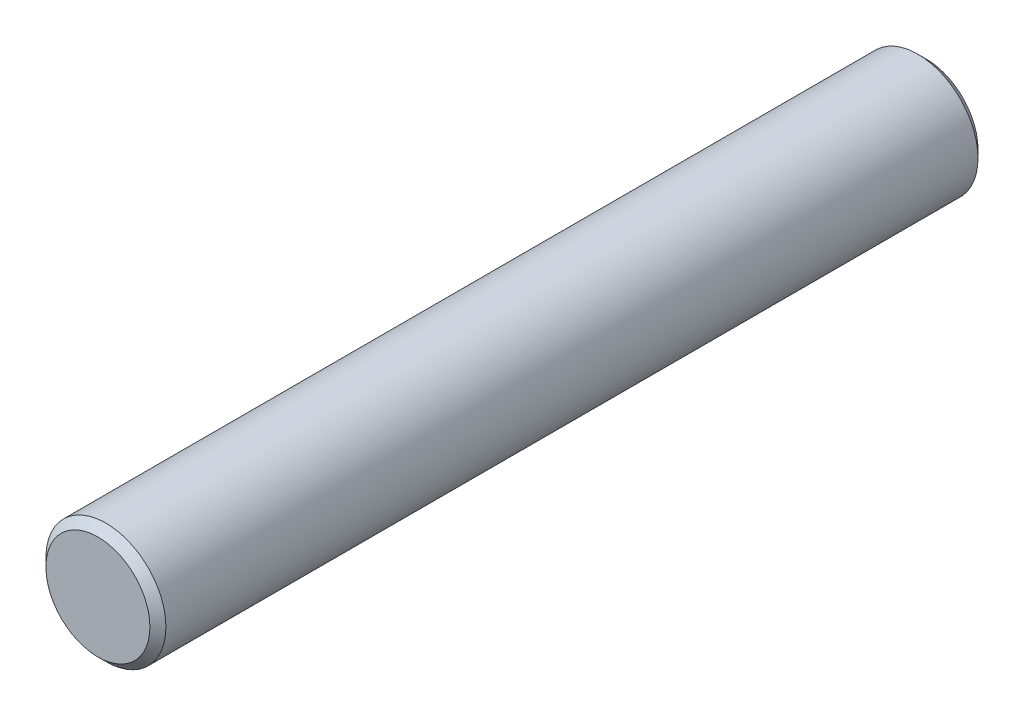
from build123d import *

# Parameters (mm, degrees)
ESQUISSE1_R      = 1.5
EXTRUSION1_DEPTH = 20.7
CHANFREIN1_SIZE  = 0.2


with BuildPart() as part:
    # Esquisse1 → Extrusion1 (new body)
    with BuildSketch(Plane.XY):
        Circle(ESQUISSE1_R)
    extrude(amount=EXTRUSION1_DEPTH)

    # Chanfrein1
    chanfrein1_edges = [part.edges().sort_by_distance(p)[0] for p in [
        (-1.5, 0, 0),
        (-1.5, 0, 20.7),
    ]]
    chamfer(chanfrein1_edges, length=CHANFREIN1_SIZE)


solid = part.part
